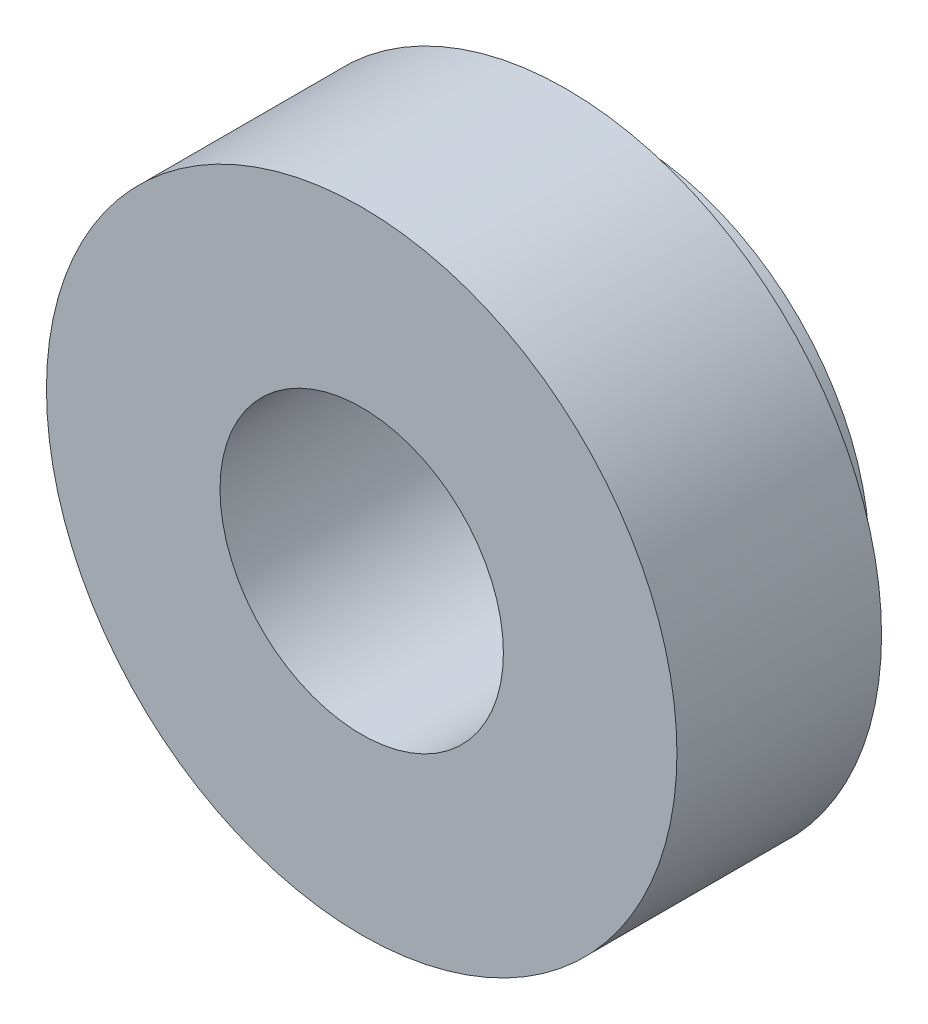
ISO-10303-21;
HEADER;
FILE_DESCRIPTION(('STEP AP214'),'2;1');
FILE_NAME('part.step','',(''),(''),'','','');
FILE_SCHEMA(('AUTOMOTIVE_DESIGN { 1 0 10303 214 1 1 1 1 }'));
ENDSEC;
DATA;
#1=APPLICATION_CONTEXT('core data for automotive mechanical design processes');
#2=APPLICATION_PROTOCOL_DEFINITION('international standard','automotive_design',2000,#1);
#3=PRODUCT_CONTEXT('',#1,'mechanical');
#4=PRODUCT('Part','Part','',(#3));
#5=PRODUCT_RELATED_PRODUCT_CATEGORY('part','',(#4));
#6=PRODUCT_DEFINITION_FORMATION('','',#4);
#7=PRODUCT_DEFINITION_CONTEXT('part definition',#1,'design');
#8=PRODUCT_DEFINITION('design','',#6,#7);
#9=PRODUCT_DEFINITION_SHAPE('','',#8);
#10=(LENGTH_UNIT() NAMED_UNIT(*) SI_UNIT(.MILLI.,.METRE.));
#11=(NAMED_UNIT(*) PLANE_ANGLE_UNIT() SI_UNIT($,.RADIAN.));
#12=(NAMED_UNIT(*) SI_UNIT($,.STERADIAN.) SOLID_ANGLE_UNIT());
#13=UNCERTAINTY_MEASURE_WITH_UNIT(LENGTH_MEASURE(1.E-05),#10,'distance_accuracy_value','');
#14=(GEOMETRIC_REPRESENTATION_CONTEXT(3) GLOBAL_UNCERTAINTY_ASSIGNED_CONTEXT((#13)) GLOBAL_UNIT_ASSIGNED_CONTEXT((#10,
#11,#12)) REPRESENTATION_CONTEXT('',''));
#15=CARTESIAN_POINT('',(0.,0.,0.));
#16=DIRECTION('',(0.,0.,1.));
#17=DIRECTION('',(1.,0.,0.));
#18=AXIS2_PLACEMENT_3D('',#15,#16,#17);
#19=CARTESIAN_POINT('',(0.,0.,13.462));
#20=DIRECTION('',(0.,0.,-1.));
#21=DIRECTION('',(-1.,0.,0.));
#22=AXIS2_PLACEMENT_3D('',#19,#20,#21);
#23=CYLINDRICAL_SURFACE('',#22,15.8496);
#24=CARTESIAN_POINT('',(0.,0.,3.175));
#25=DIRECTION('',(0.,0.,1.));
#26=DIRECTION('',(1.,0.,0.));
#27=AXIS2_PLACEMENT_3D('',#24,#25,#26);
#28=CIRCLE('',#27,15.8496);
#29=CARTESIAN_POINT('',(15.8496,0.,3.175));
#30=VERTEX_POINT('',#29);
#31=EDGE_CURVE('E35',#30,#30,#28,.T.);
#32=ORIENTED_EDGE('',*,*,#31,.T.);
#33=EDGE_LOOP('',(#32));
#34=FACE_BOUND('',#33,.T.);
#35=CARTESIAN_POINT('',(0.,0.,13.462));
#36=DIRECTION('',(0.,0.,1.));
#37=DIRECTION('',(1.,0.,0.));
#38=AXIS2_PLACEMENT_3D('',#35,#36,#37);
#39=CIRCLE('',#38,15.8496);
#40=CARTESIAN_POINT('',(15.8496,0.,13.462));
#41=VERTEX_POINT('',#40);
#42=EDGE_CURVE('E11',#41,#41,#39,.T.);
#43=ORIENTED_EDGE('',*,*,#42,.F.);
#44=EDGE_LOOP('',(#43));
#45=FACE_BOUND('',#44,.T.);
#46=ADVANCED_FACE('F32',(#34,#45),#23,.T.);
#47=CARTESIAN_POINT('',(0.,0.,13.462));
#48=DIRECTION('',(0.,0.,1.));
#49=DIRECTION('',(1.,0.,0.));
#50=AXIS2_PLACEMENT_3D('',#47,#48,#49);
#51=PLANE('',#50);
#52=CARTESIAN_POINT('',(0.,0.,13.462));
#53=DIRECTION('',(0.,0.,-1.));
#54=DIRECTION('',(-1.,0.,0.));
#55=AXIS2_PLACEMENT_3D('',#52,#53,#54);
#56=CIRCLE('',#55,7.1247);
#57=CARTESIAN_POINT('',(-7.1247,0.,13.462));
#58=VERTEX_POINT('',#57);
#59=EDGE_CURVE('E47',#58,#58,#56,.T.);
#60=ORIENTED_EDGE('',*,*,#59,.T.);
#61=EDGE_LOOP('',(#60));
#62=FACE_BOUND('',#61,.T.);
#63=ORIENTED_EDGE('',*,*,#42,.T.);
#64=EDGE_LOOP('',(#63));
#65=FACE_BOUND('',#64,.T.);
#66=ADVANCED_FACE('F56',(#62,#65),#51,.T.);
#67=CARTESIAN_POINT('',(0.,0.,3.175));
#68=DIRECTION('',(0.,0.,1.));
#69=DIRECTION('',(1.,0.,0.));
#70=AXIS2_PLACEMENT_3D('',#67,#68,#69);
#71=PLANE('',#70);
#72=CARTESIAN_POINT('',(0.,0.,3.175));
#73=DIRECTION('',(0.,0.,1.));
#74=DIRECTION('',(1.,0.,0.));
#75=AXIS2_PLACEMENT_3D('',#72,#73,#74);
#76=CIRCLE('',#75,12.065);
#77=CARTESIAN_POINT('',(12.065,0.,3.175));
#78=VERTEX_POINT('',#77);
#79=EDGE_CURVE('E42',#78,#78,#76,.T.);
#80=ORIENTED_EDGE('',*,*,#79,.T.);
#81=EDGE_LOOP('',(#80));
#82=FACE_BOUND('',#81,.T.);
#83=ORIENTED_EDGE('',*,*,#31,.F.);
#84=EDGE_LOOP('',(#83));
#85=FACE_BOUND('',#84,.T.);
#86=ADVANCED_FACE('F71',(#82,#85),#71,.F.);
#87=CARTESIAN_POINT('',(0.,0.,3.175));
#88=DIRECTION('',(0.,0.,-1.));
#89=DIRECTION('',(-1.,0.,0.));
#90=AXIS2_PLACEMENT_3D('',#87,#88,#89);
#91=CYLINDRICAL_SURFACE('',#90,12.065);
#92=ORIENTED_EDGE('',*,*,#79,.F.);
#93=EDGE_LOOP('',(#92));
#94=FACE_BOUND('',#93,.T.);
#95=CARTESIAN_POINT('',(0.,0.,0.));
#96=DIRECTION('',(0.,0.,1.));
#97=DIRECTION('',(1.,0.,0.));
#98=AXIS2_PLACEMENT_3D('',#95,#96,#97);
#99=CIRCLE('',#98,12.065);
#100=CARTESIAN_POINT('',(12.065,0.,0.));
#101=VERTEX_POINT('',#100);
#102=EDGE_CURVE('E44',#101,#101,#99,.T.);
#103=ORIENTED_EDGE('',*,*,#102,.T.);
#104=EDGE_LOOP('',(#103));
#105=FACE_BOUND('',#104,.T.);
#106=ADVANCED_FACE('F67',(#94,#105),#91,.T.);
#107=CARTESIAN_POINT('',(0.,0.,0.));
#108=DIRECTION('',(0.,0.,1.));
#109=DIRECTION('',(1.,0.,0.));
#110=AXIS2_PLACEMENT_3D('',#107,#108,#109);
#111=PLANE('',#110);
#112=CARTESIAN_POINT('',(0.,0.,0.));
#113=DIRECTION('',(0.,0.,-1.));
#114=DIRECTION('',(-1.,0.,0.));
#115=AXIS2_PLACEMENT_3D('',#112,#113,#114);
#116=CIRCLE('',#115,7.1247);
#117=CARTESIAN_POINT('',(-7.1247,0.,0.));
#118=VERTEX_POINT('',#117);
#119=EDGE_CURVE('E50',#118,#118,#116,.T.);
#120=ORIENTED_EDGE('',*,*,#119,.F.);
#121=EDGE_LOOP('',(#120));
#122=FACE_BOUND('',#121,.T.);
#123=ORIENTED_EDGE('',*,*,#102,.F.);
#124=EDGE_LOOP('',(#123));
#125=FACE_BOUND('',#124,.T.);
#126=ADVANCED_FACE('F61',(#122,#125),#111,.F.);
#127=CARTESIAN_POINT('',(0.,0.,13.462));
#128=DIRECTION('',(0.,0.,-1.));
#129=DIRECTION('',(-1.,0.,0.));
#130=AXIS2_PLACEMENT_3D('',#127,#128,#129);
#131=CYLINDRICAL_SURFACE('',#130,7.1247);
#132=ORIENTED_EDGE('',*,*,#59,.F.);
#133=EDGE_LOOP('',(#132));
#134=FACE_BOUND('',#133,.T.);
#135=ORIENTED_EDGE('',*,*,#119,.T.);
#136=EDGE_LOOP('',(#135));
#137=FACE_BOUND('',#136,.T.);
#138=ADVANCED_FACE('F58',(#134,#137),#131,.F.);
#139=CLOSED_SHELL('',(#46,#66,#86,#106,#126,#138));
#140=MANIFOLD_SOLID_BREP('B2',#139);
#141=ADVANCED_BREP_SHAPE_REPRESENTATION('',(#18,#140),#14);
#142=SHAPE_DEFINITION_REPRESENTATION(#9,#141);
ENDSEC;
END-ISO-10303-21;
